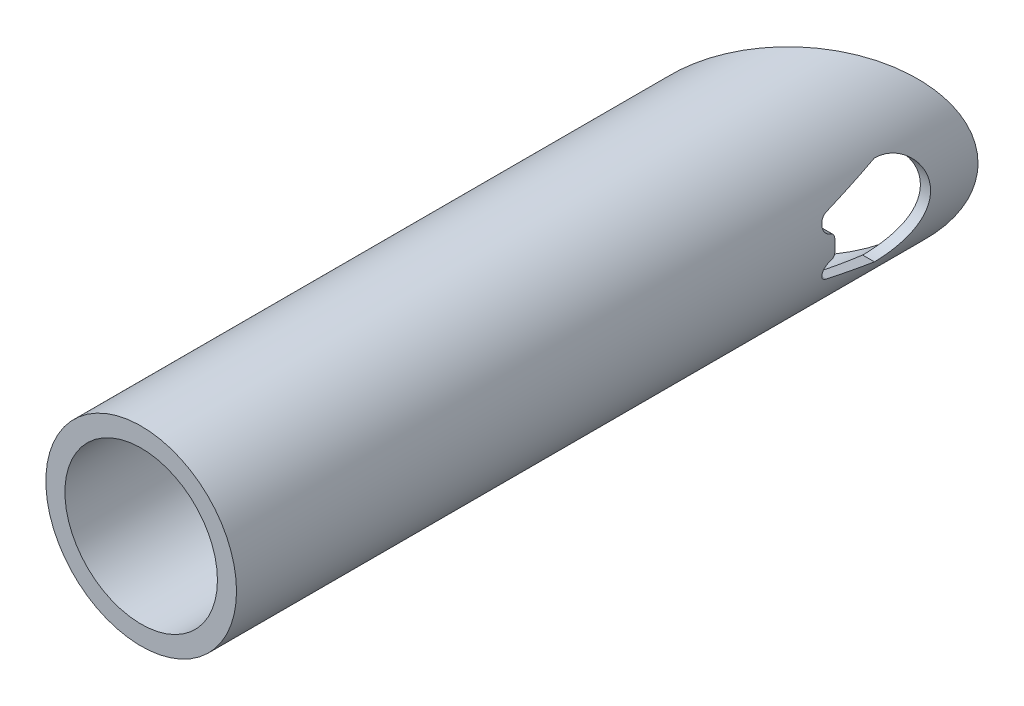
ISO-10303-21;
HEADER;
FILE_DESCRIPTION(('STEP AP214'),'2;1');
FILE_NAME('part.step','',(''),(''),'','','');
FILE_SCHEMA(('AUTOMOTIVE_DESIGN { 1 0 10303 214 1 1 1 1 }'));
ENDSEC;
DATA;
#1=APPLICATION_CONTEXT('core data for automotive mechanical design processes');
#2=APPLICATION_PROTOCOL_DEFINITION('international standard','automotive_design',2000,#1);
#3=PRODUCT_CONTEXT('',#1,'mechanical');
#4=PRODUCT('Part','Part','',(#3));
#5=PRODUCT_RELATED_PRODUCT_CATEGORY('part','',(#4));
#6=PRODUCT_DEFINITION_FORMATION('','',#4);
#7=PRODUCT_DEFINITION_CONTEXT('part definition',#1,'design');
#8=PRODUCT_DEFINITION('design','',#6,#7);
#9=PRODUCT_DEFINITION_SHAPE('','',#8);
#10=(LENGTH_UNIT() NAMED_UNIT(*) SI_UNIT(.MILLI.,.METRE.));
#11=(NAMED_UNIT(*) PLANE_ANGLE_UNIT() SI_UNIT($,.RADIAN.));
#12=(NAMED_UNIT(*) SI_UNIT($,.STERADIAN.) SOLID_ANGLE_UNIT());
#13=UNCERTAINTY_MEASURE_WITH_UNIT(LENGTH_MEASURE(1.E-05),#10,'distance_accuracy_value','');
#14=(GEOMETRIC_REPRESENTATION_CONTEXT(3) GLOBAL_UNCERTAINTY_ASSIGNED_CONTEXT((#13)) GLOBAL_UNIT_ASSIGNED_CONTEXT((#10,
#11,#12)) REPRESENTATION_CONTEXT('',''));
#15=CARTESIAN_POINT('',(0.,0.,0.));
#16=DIRECTION('',(0.,0.,1.));
#17=DIRECTION('',(1.,0.,0.));
#18=AXIS2_PLACEMENT_3D('',#15,#16,#17);
#19=CARTESIAN_POINT('',(0.,0.,111.125));
#20=DIRECTION('',(0.,0.,-1.));
#21=DIRECTION('',(-1.,0.,0.));
#22=AXIS2_PLACEMENT_3D('',#19,#20,#21);
#23=CYLINDRICAL_SURFACE('',#22,12.7635);
#24=CARTESIAN_POINT('',(0.,0.,34.925));
#25=DIRECTION('',(0.,0.,1.));
#26=DIRECTION('',(1.,0.,0.));
#27=AXIS2_PLACEMENT_3D('',#24,#25,#26);
#28=CIRCLE('',#27,12.7635);
#29=CARTESIAN_POINT('',(12.7635,0.,34.925));
#30=VERTEX_POINT('',#29);
#31=EDGE_CURVE('E284',#30,#30,#28,.T.);
#32=ORIENTED_EDGE('',*,*,#31,.T.);
#33=EDGE_LOOP('',(#32));
#34=FACE_BOUND('',#33,.T.);
#35=CARTESIAN_POINT('',(0.,0.,12.7));
#36=DIRECTION('',(0.66436383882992,0.,0.74740931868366));
#37=DIRECTION('',(0.74740931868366,0.,-0.66436383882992));
#38=AXIS2_PLACEMENT_3D('',#35,#36,#37);
#39=ELLIPSE('',#38,17.0769880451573,12.7635);
#40=CARTESIAN_POINT('',(12.7635,0.,1.35466666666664));
#41=VERTEX_POINT('',#40);
#42=EDGE_CURVE('E289',#41,#41,#39,.T.);
#43=ORIENTED_EDGE('',*,*,#42,.F.);
#44=EDGE_LOOP('',(#43));
#45=FACE_BOUND('',#44,.T.);
#46=CARTESIAN_POINT('',(0.,0.,21.4336824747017));
#47=DIRECTION('',(0.,0.,-1.));
#48=DIRECTION('',(-1.,0.,0.));
#49=AXIS2_PLACEMENT_3D('',#46,#47,#48);
#50=CIRCLE('',#49,12.7635);
#51=CARTESIAN_POINT('',(12.7236810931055,1.00740840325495,21.4336824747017));
#52=VERTEX_POINT('',#51);
#53=CARTESIAN_POINT('',(12.7236810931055,-1.00740840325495,21.4336824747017));
#54=VERTEX_POINT('',#53);
#55=EDGE_CURVE('E246',#52,#54,#50,.T.);
#56=ORIENTED_EDGE('',*,*,#55,.T.);
#57=CARTESIAN_POINT('',(12.7236810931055,-1.00740840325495,21.4336824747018));
#58=CARTESIAN_POINT('',(12.7202801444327,-1.05046942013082,21.43364695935));
#59=CARTESIAN_POINT('',(12.7166451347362,-1.09349821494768,21.4373302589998));
#60=CARTESIAN_POINT('',(12.7090669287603,-1.17826215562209,21.4518509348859));
#61=CARTESIAN_POINT('',(12.7051240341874,-1.2199985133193,21.4626813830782));
#62=CARTESIAN_POINT('',(12.6970816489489,-1.30104798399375,21.491217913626));
#63=CARTESIAN_POINT('',(12.6929821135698,-1.3403603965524,21.5089259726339));
#64=CARTESIAN_POINT('',(12.6848271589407,-1.4154562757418,21.550712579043));
#65=CARTESIAN_POINT('',(12.680771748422,-1.45123905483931,21.5747923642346));
#66=CARTESIAN_POINT('',(12.6729153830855,-1.51831947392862,21.6286987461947));
#67=CARTESIAN_POINT('',(12.6691149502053,-1.54960805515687,21.6585366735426));
#68=CARTESIAN_POINT('',(12.6620016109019,-1.60669718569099,21.7230856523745));
#69=CARTESIAN_POINT('',(12.6586880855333,-1.63250472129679,21.7577904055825));
#70=CARTESIAN_POINT('',(12.6546127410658,-1.66366513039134,21.8080851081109));
#71=CARTESIAN_POINT('',(12.65355221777,-1.67170798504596,21.8220383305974));
#72=CARTESIAN_POINT('',(12.6515380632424,-1.68688321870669,21.850406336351));
#73=CARTESIAN_POINT('',(12.650584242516,-1.69401721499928,21.8648202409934));
#74=CARTESIAN_POINT('',(12.6496867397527,-1.70069328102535,21.8794545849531));
#75=B_SPLINE_CURVE_WITH_KNOTS('',3,(#57,#58,#59,#60,#61,#62,#63,#64,#65,#66,#67,#68,#69,#70,#71,
#72,#73,#74),.UNSPECIFIED.,.F.,.F.,(4,2,2,2,2,2,2,2,4),(0.,0.12940849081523,0.258691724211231,
0.388012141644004,0.517357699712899,0.646960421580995,0.776396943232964,0.824792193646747,
0.873100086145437),.UNSPECIFIED.);
#76=CARTESIAN_POINT('',(12.6496867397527,-1.70069328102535,21.8794545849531));
#77=VERTEX_POINT('',#76);
#78=EDGE_CURVE('E232',#54,#77,#75,.T.);
#79=ORIENTED_EDGE('',*,*,#78,.T.);
#80=CARTESIAN_POINT('',(0.,0.,18.1509253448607));
#81=DIRECTION('',(0.,-0.909822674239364,-0.414997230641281));
#82=DIRECTION('',(0.,0.414997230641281,-0.909822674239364));
#83=AXIS2_PLACEMENT_3D('',#80,#81,#82);
#84=ELLIPSE('',#83,30.7556269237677,12.7635);
#85=CARTESIAN_POINT('',(12.6240083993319,-1.88184595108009,22.2766061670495));
#86=VERTEX_POINT('',#85);
#87=EDGE_CURVE('E167',#77,#86,#84,.T.);
#88=ORIENTED_EDGE('',*,*,#87,.T.);
#89=CARTESIAN_POINT('',(12.6240083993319,-1.88184595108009,22.2766061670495));
#90=CARTESIAN_POINT('',(12.6217259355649,-1.89715337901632,22.3101656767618));
#91=CARTESIAN_POINT('',(12.619207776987,-1.91385907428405,22.3430515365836));
#92=CARTESIAN_POINT('',(12.6136822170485,-1.94994624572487,22.4072739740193));
#93=CARTESIAN_POINT('',(12.6106748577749,-1.96932749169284,22.4386106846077));
#94=CARTESIAN_POINT('',(12.6009053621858,-2.03122031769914,22.5298737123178));
#95=CARTESIAN_POINT('',(12.5933862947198,-2.07754681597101,22.5871966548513));
#96=CARTESIAN_POINT('',(12.576246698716,-2.17889582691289,22.6931582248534));
#97=CARTESIAN_POINT('',(12.5666255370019,-2.23392095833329,22.7417942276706));
#98=CARTESIAN_POINT('',(12.5452482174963,-2.35100276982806,22.8291095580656));
#99=CARTESIAN_POINT('',(12.5334922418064,-2.41305884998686,22.8677897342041));
#100=CARTESIAN_POINT('',(12.5078004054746,-2.54288624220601,22.9345110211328));
#101=CARTESIAN_POINT('',(12.4938475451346,-2.61070004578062,22.9624627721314));
#102=CARTESIAN_POINT('',(12.4640069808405,-2.74963823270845,23.0066809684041));
#103=CARTESIAN_POINT('',(12.4481188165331,-2.82076340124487,23.0229446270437));
#104=CARTESIAN_POINT('',(12.4143455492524,-2.9659106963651,23.0437498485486));
#105=CARTESIAN_POINT('',(12.3964244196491,-3.0399621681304,23.0480277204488));
#106=CARTESIAN_POINT('',(12.3593308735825,-3.18742162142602,23.0441749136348));
#107=CARTESIAN_POINT('',(12.3401583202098,-3.2608295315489,23.0360428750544));
#108=CARTESIAN_POINT('',(12.300590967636,-3.40709426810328,23.007313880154));
#109=CARTESIAN_POINT('',(12.2801770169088,-3.47987932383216,22.9863774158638));
#110=CARTESIAN_POINT('',(12.2393665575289,-3.62080458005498,22.9323638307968));
#111=CARTESIAN_POINT('',(12.218970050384,-3.68894441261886,22.8992857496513));
#112=CARTESIAN_POINT('',(12.1787359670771,-3.81969535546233,22.8212440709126));
#113=CARTESIAN_POINT('',(12.1589109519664,-3.8822108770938,22.7761134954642));
#114=CARTESIAN_POINT('',(12.1210822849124,-3.99875717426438,22.6752687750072));
#115=CARTESIAN_POINT('',(12.1030795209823,-4.0527838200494,22.6195495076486));
#116=CARTESIAN_POINT('',(12.0702208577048,-4.14961086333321,22.5001225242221));
#117=CARTESIAN_POINT('',(12.0553117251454,-4.19260483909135,22.4365864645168));
#118=CARTESIAN_POINT('',(12.0291668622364,-4.26704173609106,22.3025388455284));
#119=CARTESIAN_POINT('',(12.0179207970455,-4.29851718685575,22.2320476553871));
#120=CARTESIAN_POINT('',(12.006325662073,-4.3307188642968,22.1386374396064));
#121=CARTESIAN_POINT('',(12.0039485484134,-4.33730113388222,22.1178849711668));
#122=CARTESIAN_POINT('',(12.0017559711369,-4.34336112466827,22.0969720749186));
#123=B_SPLINE_CURVE_WITH_KNOTS('',3,(#89,#90,#91,#92,#93,#94,#95,#96,#97,#98,#99,#100,#101,#102,
#103,#104,#105,#106,#107,#108,#109,#110,#111,#112,#113,#114,#115,#116,#117,#118,#119,#120,#121,
#122),.UNSPECIFIED.,.F.,.F.,(4,2,2,2,2,2,2,2,2,2,2,2,2,2,2,2,4),(0.,0.110799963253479,
0.221590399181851,0.442702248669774,0.663880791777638,0.885040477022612,1.10800422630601,
1.33102111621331,1.55890731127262,1.78681847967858,2.02105169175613,2.25530343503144,
2.49298598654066,2.73078381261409,2.96406910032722,3.19669038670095,3.26236128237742),.UNSPECIFIED.);
#124=CARTESIAN_POINT('',(12.0017559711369,-4.34336112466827,22.0969720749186));
#125=VERTEX_POINT('',#124);
#126=EDGE_CURVE('E159',#86,#125,#123,.T.);
#127=ORIENTED_EDGE('',*,*,#126,.T.);
#128=CARTESIAN_POINT('',(0.,0.,37.0748335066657));
#129=DIRECTION('',(0.,0.960432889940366,-0.278511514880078));
#130=DIRECTION('',(0.,-0.278511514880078,-0.960432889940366));
#131=AXIS2_PLACEMENT_3D('',#128,#129,#130);
#132=ELLIPSE('',#131,45.8275486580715,12.7635);
#133=CARTESIAN_POINT('',(10.8408720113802,-6.73664800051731,13.8438431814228));
#134=VERTEX_POINT('',#133);
#135=EDGE_CURVE('E157',#125,#134,#132,.T.);
#136=ORIENTED_EDGE('',*,*,#135,.T.);
#137=CARTESIAN_POINT('',(10.8408720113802,-6.73664800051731,13.8438431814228));
#138=CARTESIAN_POINT('',(10.8408142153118,-6.7366827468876,13.6689739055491));
#139=CARTESIAN_POINT('',(10.8451012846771,-6.72984083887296,13.4941326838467));
#140=CARTESIAN_POINT('',(10.8619332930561,-6.70267115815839,13.1460200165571));
#141=CARTESIAN_POINT('',(10.8744724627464,-6.68235280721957,12.9727475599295));
#142=CARTESIAN_POINT('',(10.9072740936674,-6.62866694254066,12.6301224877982));
#143=CARTESIAN_POINT('',(10.9274873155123,-6.59538258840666,12.4607520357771));
#144=CARTESIAN_POINT('',(10.974886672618,-6.51620552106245,12.1259728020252));
#145=CARTESIAN_POINT('',(11.0020737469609,-6.47031110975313,11.9605645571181));
#146=CARTESIAN_POINT('',(11.0624220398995,-6.366579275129,11.6351845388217));
#147=CARTESIAN_POINT('',(11.095566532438,-6.30877522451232,11.4751989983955));
#148=CARTESIAN_POINT('',(11.166863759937,-6.18169820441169,11.1609748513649));
#149=CARTESIAN_POINT('',(11.2050184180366,-6.1124208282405,11.0067384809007));
#150=CARTESIAN_POINT('',(11.3254966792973,-5.88803135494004,10.553362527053));
#151=CARTESIAN_POINT('',(11.4137855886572,-5.71644227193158,10.2638052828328));
#152=CARTESIAN_POINT('',(11.6060996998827,-5.31591739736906,9.68969107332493));
#153=CARTESIAN_POINT('',(11.7108254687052,-5.08316359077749,9.4080324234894));
#154=CARTESIAN_POINT('',(11.8665435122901,-4.70223380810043,9.01635327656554));
#155=CARTESIAN_POINT('',(11.9182464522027,-4.56988365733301,8.89087366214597));
#156=CARTESIAN_POINT('',(12.020028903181,-4.295030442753,8.65072955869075));
#157=CARTESIAN_POINT('',(12.0701081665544,-4.15252584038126,8.53606671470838));
#158=CARTESIAN_POINT('',(12.1712269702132,-3.84657070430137,8.3098318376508));
#159=CARTESIAN_POINT('',(12.2220383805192,-3.68235308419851,8.19919344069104));
#160=CARTESIAN_POINT('',(12.3189502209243,-3.34385552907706,7.99231539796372));
#161=CARTESIAN_POINT('',(12.3650526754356,-3.16957996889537,7.89606955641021));
#162=CARTESIAN_POINT('',(12.4512355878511,-2.81202231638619,7.71891457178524));
#163=CARTESIAN_POINT('',(12.4913177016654,-2.62874271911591,7.63800120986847));
#164=CARTESIAN_POINT('',(12.5642643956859,-2.2544462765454,7.49244937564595));
#165=CARTESIAN_POINT('',(12.5971298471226,-2.06343036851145,7.42780893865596));
#166=CARTESIAN_POINT('',(12.6523705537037,-1.69032644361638,7.32004507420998));
#167=CARTESIAN_POINT('',(12.6753629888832,-1.50869991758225,7.27563894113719));
#168=CARTESIAN_POINT('',(12.7136829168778,-1.14159761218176,7.20198958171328));
#169=CARTESIAN_POINT('',(12.7290107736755,-0.956122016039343,7.1727456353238));
#170=CARTESIAN_POINT('',(12.7515476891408,-0.58299118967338,7.12984320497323));
#171=CARTESIAN_POINT('',(12.7587613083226,-0.395337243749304,7.11617596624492));
#172=CARTESIAN_POINT('',(12.7648691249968,-0.0194138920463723,7.10459959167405));
#173=CARTESIAN_POINT('',(12.7637639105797,0.168855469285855,7.10668934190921));
#174=CARTESIAN_POINT('',(12.7537808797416,0.526101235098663,7.12562373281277));
#175=CARTESIAN_POINT('',(12.7456670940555,0.695178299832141,7.14101807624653));
#176=CARTESIAN_POINT('',(12.7228813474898,1.03131215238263,7.18444781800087));
#177=CARTESIAN_POINT('',(12.7082071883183,1.19836824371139,7.2124874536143));
#178=CARTESIAN_POINT('',(12.6726541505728,1.52919600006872,7.28087822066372));
#179=CARTESIAN_POINT('',(12.6517775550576,1.69296884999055,7.32122482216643));
#180=CARTESIAN_POINT('',(12.6042889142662,2.01632158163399,7.41382205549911));
#181=CARTESIAN_POINT('',(12.5776746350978,2.17589980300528,7.46607732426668));
#182=CARTESIAN_POINT('',(12.5189516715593,2.49176347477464,7.5826759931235));
#183=CARTESIAN_POINT('',(12.4867812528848,2.64798696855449,7.64715610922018));
#184=CARTESIAN_POINT('',(12.4178679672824,2.95434970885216,7.78722339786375));
#185=CARTESIAN_POINT('',(12.3811235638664,3.10448688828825,7.86281430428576));
#186=CARTESIAN_POINT('',(12.2651701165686,3.54462878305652,8.1053621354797));
#187=CARTESIAN_POINT('',(12.1802045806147,3.82455136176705,8.28816406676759));
#188=CARTESIAN_POINT('',(11.992506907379,4.3796286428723,8.71203912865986));
#189=CARTESIAN_POINT('',(11.8888465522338,4.65138385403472,8.95715433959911));
#190=CARTESIAN_POINT('',(11.7328326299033,5.02653368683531,9.35499906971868));
#191=CARTESIAN_POINT('',(11.6806947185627,5.14626067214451,9.49277698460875));
#192=CARTESIAN_POINT('',(11.5775079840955,5.3743731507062,9.77790462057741));
#193=CARTESIAN_POINT('',(11.5264593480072,5.48275670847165,9.92525596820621));
#194=CARTESIAN_POINT('',(11.4229409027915,5.69547378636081,10.2406572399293));
#195=CARTESIAN_POINT('',(11.3706685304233,5.79883934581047,10.4094259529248));
#196=CARTESIAN_POINT('',(11.2707275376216,5.99077104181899,10.756390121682));
#197=CARTESIAN_POINT('',(11.2230568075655,6.07934397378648,10.9345811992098));
#198=CARTESIAN_POINT('',(11.134145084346,6.24069062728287,11.299074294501));
#199=CARTESIAN_POINT('',(11.0928910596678,6.31349649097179,11.4853588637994));
#200=CARTESIAN_POINT('',(11.0184115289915,6.44260114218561,11.8650843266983));
#201=CARTESIAN_POINT('',(10.9851826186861,6.49890693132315,12.0585221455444));
#202=CARTESIAN_POINT('',(10.9380252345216,6.57783045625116,12.3836412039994));
#203=CARTESIAN_POINT('',(10.9213856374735,6.60537947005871,12.5137557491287));
#204=CARTESIAN_POINT('',(10.8925741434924,6.6527835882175,12.7758444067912));
#205=CARTESIAN_POINT('',(10.880400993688,6.67264085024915,12.9078179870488));
#206=CARTESIAN_POINT('',(10.860773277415,6.70454384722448,13.1734329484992));
#207=CARTESIAN_POINT('',(10.8533320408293,6.71656751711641,13.3070779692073));
#208=CARTESIAN_POINT('',(10.8433699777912,6.73262764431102,13.5750932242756));
#209=CARTESIAN_POINT('',(10.8408515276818,6.73666024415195,13.7094637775));
#210=CARTESIAN_POINT('',(10.8408720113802,6.73664800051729,13.8438431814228));
#211=B_SPLINE_CURVE_WITH_KNOTS('',3,(#137,#138,#139,#140,#141,#142,#143,#144,#145,#146,#147,
#148,#149,#150,#151,#152,#153,#154,#155,#156,#157,#158,#159,#160,#161,#162,#163,#164,#165,#166,
#167,#168,#169,#170,#171,#172,#173,#174,#175,#176,#177,#178,#179,#180,#181,#182,#183,#184,#185,
#186,#187,#188,#189,#190,#191,#192,#193,#194,#195,#196,#197,#198,#199,#200,#201,#202,#203,#204,
#205,#206,#207,#208,#209,#210),.UNSPECIFIED.,.F.,.F.,(4,2,2,2,2,2,2,2,2,2,2,2,2,2,2,2,2,2,2,2,2,
2,2,2,2,2,2,2,2,2,2,2,2,2,2,2,4),(0.,0.524377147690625,1.04838807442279,1.5690920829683,
2.08986624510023,2.60920049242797,3.12873467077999,4.16859335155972,5.30389535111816,
5.87211155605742,6.4404140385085,7.05290696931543,7.66513546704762,8.27719526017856,
8.88918112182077,9.45355766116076,10.0179073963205,10.5819397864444,11.1459323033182,
11.6552394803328,12.1647174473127,12.6740081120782,13.1834974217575,13.6990622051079,
14.2148006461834,15.2456739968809,16.3817106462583,16.9507297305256,17.5198457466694,
18.1331529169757,18.746177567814,19.3579405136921,19.969443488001,20.3712747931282,
20.7729932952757,21.1758384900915,21.5788780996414),.UNSPECIFIED.);
#212=CARTESIAN_POINT('',(10.8408720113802,6.73664800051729,13.8438431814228));
#213=VERTEX_POINT('',#212);
#214=EDGE_CURVE('E141',#134,#213,#211,.T.);
#215=ORIENTED_EDGE('',*,*,#214,.T.);
#216=CARTESIAN_POINT('',(0.,0.,37.0748335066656));
#217=DIRECTION('',(0.,-0.960432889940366,-0.278511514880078));
#218=DIRECTION('',(0.,0.278511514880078,-0.960432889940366));
#219=AXIS2_PLACEMENT_3D('',#216,#217,#218);
#220=ELLIPSE('',#219,45.8275486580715,12.7635);
#221=CARTESIAN_POINT('',(12.0017559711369,4.34336112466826,22.0969720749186));
#222=VERTEX_POINT('',#221);
#223=EDGE_CURVE('E258',#213,#222,#220,.T.);
#224=ORIENTED_EDGE('',*,*,#223,.T.);
#225=CARTESIAN_POINT('',(12.0017559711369,4.34336112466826,22.0969720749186));
#226=CARTESIAN_POINT('',(12.0054667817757,4.33310502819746,22.1323418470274));
#227=CARTESIAN_POINT('',(12.0096949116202,4.32138292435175,22.1672100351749));
#228=CARTESIAN_POINT('',(12.019111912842,4.29512284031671,22.2357218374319));
#229=CARTESIAN_POINT('',(12.0243004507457,4.28058583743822,22.2693658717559));
#230=CARTESIAN_POINT('',(12.0411599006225,4.23302839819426,22.3679297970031));
#231=CARTESIAN_POINT('',(12.0541523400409,4.19598625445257,22.4307382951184));
#232=CARTESIAN_POINT('',(12.0828838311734,4.1125162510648,22.5488977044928));
#233=CARTESIAN_POINT('',(12.0986203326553,4.06609709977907,22.6042554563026));
#234=CARTESIAN_POINT('',(12.132064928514,3.96519300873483,22.7064076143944));
#235=CARTESIAN_POINT('',(12.1497741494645,3.91070345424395,22.753197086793));
#236=CARTESIAN_POINT('',(12.1871047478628,3.79280612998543,22.8388560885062));
#237=CARTESIAN_POINT('',(12.2067743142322,3.72912846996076,22.8773330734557));
#238=CARTESIAN_POINT('',(12.246558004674,3.59632492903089,22.9430101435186));
#239=CARTESIAN_POINT('',(12.2666722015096,3.52719815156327,22.9702083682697));
#240=CARTESIAN_POINT('',(12.3072339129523,3.38300245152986,23.013309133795));
#241=CARTESIAN_POINT('',(12.3276715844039,3.30781430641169,23.0288235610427));
#242=CARTESIAN_POINT('',(12.367507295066,3.15561118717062,23.0465682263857));
#243=CARTESIAN_POINT('',(12.3869053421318,3.07859622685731,23.0487985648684));
#244=CARTESIAN_POINT('',(12.4239889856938,2.92534013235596,23.0397555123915));
#245=CARTESIAN_POINT('',(12.4416825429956,2.84909705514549,23.0285485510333));
#246=CARTESIAN_POINT('',(12.4750334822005,2.69932538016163,22.992855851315));
#247=CARTESIAN_POINT('',(12.4906913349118,2.62579615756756,22.968373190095));
#248=CARTESIAN_POINT('',(12.5193159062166,2.48568798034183,22.9074960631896));
#249=CARTESIAN_POINT('',(12.5323431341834,2.41897616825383,22.8714358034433));
#250=CARTESIAN_POINT('',(12.5561088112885,2.29242574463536,22.7881402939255));
#251=CARTESIAN_POINT('',(12.5668464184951,2.23258966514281,22.7409009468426));
#252=CARTESIAN_POINT('',(12.5857980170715,2.12312018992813,22.6378607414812));
#253=CARTESIAN_POINT('',(12.5940665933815,2.07327565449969,22.5822936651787));
#254=CARTESIAN_POINT('',(12.6084904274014,1.98367500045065,22.4634486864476));
#255=CARTESIAN_POINT('',(12.6146505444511,1.94389574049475,22.4001889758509));
#256=CARTESIAN_POINT('',(12.62129518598,1.89998253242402,22.3151288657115));
#257=CARTESIAN_POINT('',(12.6226918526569,1.89067597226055,22.2959733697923));
#258=CARTESIAN_POINT('',(12.6240083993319,1.88184595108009,22.2766061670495));
#259=B_SPLINE_CURVE_WITH_KNOTS('',3,(#225,#226,#227,#228,#229,#230,#231,#232,#233,#234,#235,
#236,#237,#238,#239,#240,#241,#242,#243,#244,#245,#246,#247,#248,#249,#250,#251,#252,#253,#254,
#255,#256,#257,#258),.UNSPECIFIED.,.F.,.F.,(4,2,2,2,2,2,2,2,2,2,2,2,2,2,2,2,4),(0.,
0.110963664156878,0.221888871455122,0.442942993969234,0.663792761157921,0.884769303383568,
1.11460164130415,1.34447187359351,1.58167680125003,1.81887993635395,2.05491523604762,
2.29089584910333,2.52059886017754,2.75038619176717,2.97463538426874,3.19836421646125,
3.26236300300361),.UNSPECIFIED.);
#260=CARTESIAN_POINT('',(12.6240083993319,1.88184595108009,22.2766061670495));
#261=VERTEX_POINT('',#260);
#262=EDGE_CURVE('E250',#222,#261,#259,.T.);
#263=ORIENTED_EDGE('',*,*,#262,.T.);
#264=CARTESIAN_POINT('',(0.,0.,18.1509253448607));
#265=DIRECTION('',(0.,0.909822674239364,-0.414997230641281));
#266=DIRECTION('',(0.,-0.414997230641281,-0.909822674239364));
#267=AXIS2_PLACEMENT_3D('',#264,#265,#266);
#268=ELLIPSE('',#267,30.7556269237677,12.7635);
#269=CARTESIAN_POINT('',(12.6496867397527,1.70069328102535,21.8794545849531));
#270=VERTEX_POINT('',#269);
#271=EDGE_CURVE('E248',#261,#270,#268,.T.);
#272=ORIENTED_EDGE('',*,*,#271,.T.);
#273=CARTESIAN_POINT('',(12.6496867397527,1.70069328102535,21.8794545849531));
#274=CARTESIAN_POINT('',(12.6520777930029,1.68289742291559,21.8403539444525));
#275=CARTESIAN_POINT('',(12.6548844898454,1.66175025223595,21.8028259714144));
#276=CARTESIAN_POINT('',(12.6611237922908,1.61352891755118,21.731911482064));
#277=CARTESIAN_POINT('',(12.6645556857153,1.58646149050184,21.6985203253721));
#278=CARTESIAN_POINT('',(12.6718469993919,1.52712614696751,21.6367770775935));
#279=CARTESIAN_POINT('',(12.6757064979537,1.49485727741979,21.6084259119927));
#280=CARTESIAN_POINT('',(12.6836336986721,1.42603193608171,21.5575375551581));
#281=CARTESIAN_POINT('',(12.6877014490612,1.3894744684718,21.5350017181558));
#282=CARTESIAN_POINT('',(12.6958535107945,1.31290719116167,21.4962784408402));
#283=CARTESIAN_POINT('',(12.6999377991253,1.27288052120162,21.480124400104));
#284=CARTESIAN_POINT('',(12.7079073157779,1.19068105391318,21.4548051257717));
#285=CARTESIAN_POINT('',(12.7117927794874,1.14851091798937,21.4456314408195));
#286=CARTESIAN_POINT('',(12.716919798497,1.08956652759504,21.4379444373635));
#287=CARTESIAN_POINT('',(12.7183145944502,1.07316306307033,21.4363456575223));
#288=CARTESIAN_POINT('',(12.7210436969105,1.04031244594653,21.4342160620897));
#289=CARTESIAN_POINT('',(12.7223781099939,1.02386542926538,21.4336832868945));
#290=CARTESIAN_POINT('',(12.7236810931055,1.00740840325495,21.4336824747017));
#291=B_SPLINE_CURVE_WITH_KNOTS('',3,(#273,#274,#275,#276,#277,#278,#279,#280,#281,#282,#283,
#284,#285,#286,#287,#288,#289,#290),.UNSPECIFIED.,.F.,.F.,(4,2,2,2,2,2,2,2,4),(0.,
0.128897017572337,0.257648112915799,0.386422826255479,0.515227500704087,0.644697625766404,
0.774010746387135,0.823604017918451,0.873106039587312),.UNSPECIFIED.);
#292=EDGE_CURVE('E233',#270,#52,#291,.T.);
#293=ORIENTED_EDGE('',*,*,#292,.T.);
#294=EDGE_LOOP('',(#56,#79,#88,#127,#136,#215,#224,#263,#272,#293));
#295=FACE_BOUND('',#294,.T.);
#296=ADVANCED_FACE('F35',(#34,#45,#295),#23,.F.);
#297=CARTESIAN_POINT('',(0.,0.,111.125));
#298=DIRECTION('',(0.,0.,-1.));
#299=DIRECTION('',(-1.,0.,0.));
#300=AXIS2_PLACEMENT_3D('',#297,#298,#299);
#301=CYLINDRICAL_SURFACE('',#300,14.2875);
#302=CARTESIAN_POINT('',(0.,0.,111.125));
#303=DIRECTION('',(0.,0.,1.));
#304=DIRECTION('',(1.,0.,0.));
#305=AXIS2_PLACEMENT_3D('',#302,#303,#304);
#306=CIRCLE('',#305,14.2875);
#307=CARTESIAN_POINT('',(14.2875,0.,111.125));
#308=VERTEX_POINT('',#307);
#309=EDGE_CURVE('E288',#308,#308,#306,.T.);
#310=ORIENTED_EDGE('',*,*,#309,.F.);
#311=EDGE_LOOP('',(#310));
#312=FACE_BOUND('',#311,.T.);
#313=CARTESIAN_POINT('',(0.,0.,12.7));
#314=DIRECTION('',(0.66436383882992,0.,0.74740931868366));
#315=DIRECTION('',(0.74740931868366,0.,-0.66436383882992));
#316=AXIS2_PLACEMENT_3D('',#313,#314,#315);
#317=ELLIPSE('',#316,19.1160313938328,14.2875);
#318=CARTESIAN_POINT('',(14.2875,0.,0.));
#319=VERTEX_POINT('',#318);
#320=EDGE_CURVE('E285',#319,#319,#317,.T.);
#321=ORIENTED_EDGE('',*,*,#320,.T.);
#322=EDGE_LOOP('',(#321));
#323=FACE_BOUND('',#322,.T.);
#324=CARTESIAN_POINT('',(0.,0.,18.1509253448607));
#325=DIRECTION('',(0.,-0.909822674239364,-0.414997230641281));
#326=DIRECTION('',(0.,0.414997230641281,-0.909822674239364));
#327=AXIS2_PLACEMENT_3D('',#324,#325,#326);
#328=ELLIPSE('',#327,34.4279405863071,14.2875);
#329=CARTESIAN_POINT('',(14.185919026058,-1.70069328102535,21.8794545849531));
#330=VERTEX_POINT('',#329);
#331=CARTESIAN_POINT('',(14.1630262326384,-1.88184595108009,22.2766061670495));
#332=VERTEX_POINT('',#331);
#333=EDGE_CURVE('E126',#330,#332,#328,.T.);
#334=ORIENTED_EDGE('',*,*,#333,.F.);
#335=CARTESIAN_POINT('',(14.185919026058,-1.70069328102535,21.8794545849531));
#336=CARTESIAN_POINT('',(14.1880501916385,-1.68290515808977,21.8403704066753));
#337=CARTESIAN_POINT('',(14.1905522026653,-1.66176563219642,21.8028523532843));
#338=CARTESIAN_POINT('',(14.1961153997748,-1.61355533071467,21.7319465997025));
#339=CARTESIAN_POINT('',(14.1991759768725,-1.5864910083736,21.6985544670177));
#340=CARTESIAN_POINT('',(14.2056799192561,-1.52715420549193,21.6368028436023));
#341=CARTESIAN_POINT('',(14.2091233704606,-1.49488055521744,21.6084444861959));
#342=CARTESIAN_POINT('',(14.2161970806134,-1.4260409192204,21.557542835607));
#343=CARTESIAN_POINT('',(14.2198273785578,-1.38947403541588,21.5350007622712));
#344=CARTESIAN_POINT('',(14.2271000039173,-1.31292258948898,21.4962869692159));
#345=CARTESIAN_POINT('',(14.2307423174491,-1.27292425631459,21.4801425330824));
#346=CARTESIAN_POINT('',(14.2378500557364,-1.19078703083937,21.4548331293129));
#347=CARTESIAN_POINT('',(14.2413156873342,-1.14865076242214,21.4456598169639));
#348=CARTESIAN_POINT('',(14.2458925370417,-1.08971316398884,21.4379596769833));
#349=CARTESIAN_POINT('',(14.2471400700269,-1.07327978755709,21.4363551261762));
#350=CARTESIAN_POINT('',(14.2495809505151,-1.04037015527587,21.4342179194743));
#351=CARTESIAN_POINT('',(14.2507743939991,-1.02389403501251,21.4336832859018));
#352=CARTESIAN_POINT('',(14.2519396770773,-1.00740840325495,21.4336824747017));
#353=B_SPLINE_CURVE_WITH_KNOTS('',3,(#335,#336,#337,#338,#339,#340,#341,#342,#343,#344,#345,
#346,#347,#348,#349,#350,#351,#352),.UNSPECIFIED.,.F.,.F.,(4,2,2,2,2,2,2,2,4),(0.,
0.128803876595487,0.257468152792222,0.386161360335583,0.514881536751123,0.644144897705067,
0.773253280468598,0.822901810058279,0.872458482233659),.UNSPECIFIED.);
#354=CARTESIAN_POINT('',(14.2519396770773,-1.00740840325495,21.4336824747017));
#355=VERTEX_POINT('',#354);
#356=EDGE_CURVE('E44',#330,#355,#353,.T.);
#357=ORIENTED_EDGE('',*,*,#356,.T.);
#358=CARTESIAN_POINT('',(0.,0.,21.4336824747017));
#359=DIRECTION('',(0.,0.,-1.));
#360=DIRECTION('',(-1.,0.,0.));
#361=AXIS2_PLACEMENT_3D('',#358,#359,#360);
#362=CIRCLE('',#361,14.2875);
#363=CARTESIAN_POINT('',(14.2519396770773,1.00740840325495,21.4336824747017));
#364=VERTEX_POINT('',#363);
#365=EDGE_CURVE('E127',#364,#355,#362,.T.);
#366=ORIENTED_EDGE('',*,*,#365,.F.);
#367=CARTESIAN_POINT('',(14.2519396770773,1.00740840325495,21.4336824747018));
#368=CARTESIAN_POINT('',(14.2489061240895,1.05043090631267,21.4336467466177));
#369=CARTESIAN_POINT('',(14.2456639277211,1.09342557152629,21.4373237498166));
#370=CARTESIAN_POINT('',(14.2389048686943,1.17813019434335,21.4518224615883));
#371=CARTESIAN_POINT('',(14.2353882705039,1.21984133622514,21.4626373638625));
#372=CARTESIAN_POINT('',(14.228215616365,1.30084880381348,21.4911364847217));
#373=CARTESIAN_POINT('',(14.2245595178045,1.340144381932,21.5088228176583));
#374=CARTESIAN_POINT('',(14.2172871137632,1.41521134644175,21.5505593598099));
#375=CARTESIAN_POINT('',(14.2136708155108,1.45098210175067,21.5746107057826));
#376=CARTESIAN_POINT('',(14.206666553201,1.5180326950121,21.6284435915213));
#377=CARTESIAN_POINT('',(14.2032789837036,1.549304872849,21.6582347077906));
#378=CARTESIAN_POINT('',(14.1969381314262,1.60637141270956,21.7226770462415));
#379=CARTESIAN_POINT('',(14.1939843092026,1.63217259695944,21.7573221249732));
#380=CARTESIAN_POINT('',(14.1903427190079,1.66340124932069,21.807634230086));
#381=CARTESIAN_POINT('',(14.189389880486,1.6715055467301,21.8216741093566));
#382=CARTESIAN_POINT('',(14.1875808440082,1.68679126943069,21.8502205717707));
#383=CARTESIAN_POINT('',(14.1867244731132,1.69397434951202,21.8647262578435));
#384=CARTESIAN_POINT('',(14.185919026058,1.70069328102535,21.8794545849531));
#385=B_SPLINE_CURVE_WITH_KNOTS('',3,(#367,#368,#369,#370,#371,#372,#373,#374,#375,#376,#377,
#378,#379,#380,#381,#382,#383,#384),.UNSPECIFIED.,.F.,.F.,(4,2,2,2,2,2,2,2,4),(0.,
0.129212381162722,0.258301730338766,0.387430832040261,0.516583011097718,0.645952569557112,
0.7751598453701,0.823851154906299,0.87245373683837),.UNSPECIFIED.);
#386=CARTESIAN_POINT('',(14.185919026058,1.70069328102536,21.8794545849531));
#387=VERTEX_POINT('',#386);
#388=EDGE_CURVE('E51',#364,#387,#385,.T.);
#389=ORIENTED_EDGE('',*,*,#388,.T.);
#390=CARTESIAN_POINT('',(0.,0.,18.1509253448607));
#391=DIRECTION('',(0.,0.909822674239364,-0.414997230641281));
#392=DIRECTION('',(0.,-0.414997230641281,-0.909822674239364));
#393=AXIS2_PLACEMENT_3D('',#390,#391,#392);
#394=ELLIPSE('',#393,34.4279405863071,14.2875);
#395=CARTESIAN_POINT('',(14.1630262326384,1.88184595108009,22.2766061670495));
#396=VERTEX_POINT('',#395);
#397=EDGE_CURVE('E136',#396,#387,#394,.T.);
#398=ORIENTED_EDGE('',*,*,#397,.F.);
#399=CARTESIAN_POINT('',(13.6113140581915,4.34336112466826,22.0969720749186));
#400=CARTESIAN_POINT('',(13.6145893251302,4.33309477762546,22.1323766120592));
#401=CARTESIAN_POINT('',(13.6183229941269,4.32135637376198,22.1672905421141));
#402=CARTESIAN_POINT('',(13.6266448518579,4.29504380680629,22.2359167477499));
#403=CARTESIAN_POINT('',(13.6312327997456,4.28047044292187,22.2696293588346));
#404=CARTESIAN_POINT('',(13.6461560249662,4.23275221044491,22.36845345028));
#405=CARTESIAN_POINT('',(13.6576723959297,4.19554224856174,22.4314799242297));
#406=CARTESIAN_POINT('',(13.6831841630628,4.11157443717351,22.5501158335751));
#407=CARTESIAN_POINT('',(13.6971779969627,4.06482260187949,22.6057299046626));
#408=CARTESIAN_POINT('',(13.7269541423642,3.96310374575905,22.7083323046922));
#409=CARTESIAN_POINT('',(13.7427372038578,3.90813327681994,22.7553169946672));
#410=CARTESIAN_POINT('',(13.7758934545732,3.7896323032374,22.84088747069));
#411=CARTESIAN_POINT('',(13.7933010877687,3.72588656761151,22.8791617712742));
#412=CARTESIAN_POINT('',(13.8285219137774,3.59296027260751,22.9444371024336));
#413=CARTESIAN_POINT('',(13.8463351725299,3.52377882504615,22.9714362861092));
#414=CARTESIAN_POINT('',(13.8821437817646,3.37999427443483,23.0139868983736));
#415=CARTESIAN_POINT('',(13.9001323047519,3.30529819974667,23.0292308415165));
#416=CARTESIAN_POINT('',(13.9351998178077,3.15418402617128,23.0466176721));
#417=CARTESIAN_POINT('',(13.9522788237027,3.07776595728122,23.0487607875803));
#418=CARTESIAN_POINT('',(13.9849574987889,2.92568736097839,23.039764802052));
#419=CARTESIAN_POINT('',(14.0005624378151,2.85002507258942,23.0286751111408));
#420=CARTESIAN_POINT('',(14.0299893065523,2.7014426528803,22.99345305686));
#421=CARTESIAN_POINT('',(14.0438115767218,2.62852199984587,22.9693231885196));
#422=CARTESIAN_POINT('',(14.0691718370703,2.4891718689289,22.9092286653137));
#423=CARTESIAN_POINT('',(14.0807517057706,2.42263822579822,22.8735232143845));
#424=CARTESIAN_POINT('',(14.1018898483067,2.29640193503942,22.7910613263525));
#425=CARTESIAN_POINT('',(14.1114473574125,2.23670187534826,22.7443007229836));
#426=CARTESIAN_POINT('',(14.1283773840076,2.1271180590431,22.6420520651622));
#427=CARTESIAN_POINT('',(14.1357879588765,2.07706937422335,22.5867466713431));
#428=CARTESIAN_POINT('',(14.1487262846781,1.98702695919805,22.4684268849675));
#429=CARTESIAN_POINT('',(14.1542582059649,1.94701101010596,22.4054299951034));
#430=CARTESIAN_POINT('',(14.1603660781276,1.90178941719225,22.318838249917));
#431=CARTESIAN_POINT('',(14.1617391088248,1.89153079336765,22.2978492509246));
#432=CARTESIAN_POINT('',(14.1630262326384,1.88184595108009,22.2766061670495));
#433=B_SPLINE_CURVE_WITH_KNOTS('',3,(#399,#400,#401,#402,#403,#404,#405,#406,#407,#408,#409,
#410,#411,#412,#413,#414,#415,#416,#417,#418,#419,#420,#421,#422,#423,#424,#425,#426,#427,#428,
#429,#430,#431,#432),.UNSPECIFIED.,.F.,.F.,(4,2,2,2,2,2,2,2,2,2,2,2,2,2,2,2,4),(0.,
0.110950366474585,0.221869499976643,0.44299929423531,0.663990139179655,0.885073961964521,
1.11312775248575,1.34121888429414,1.57509096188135,1.80895896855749,2.04195645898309,
2.27490938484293,2.50296971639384,2.73111613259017,2.95492866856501,3.1782410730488,
3.24841071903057),.UNSPECIFIED.);
#434=CARTESIAN_POINT('',(13.6113140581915,4.34336112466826,22.0969720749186));
#435=VERTEX_POINT('',#434);
#436=EDGE_CURVE('E137',#435,#396,#433,.T.);
#437=ORIENTED_EDGE('',*,*,#436,.F.);
#438=CARTESIAN_POINT('',(0.,0.,37.0748335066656));
#439=DIRECTION('',(0.,-0.960432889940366,-0.278511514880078));
#440=DIRECTION('',(0.,0.278511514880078,-0.960432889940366));
#441=AXIS2_PLACEMENT_3D('',#438,#439,#440);
#442=ELLIPSE('',#441,51.299494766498,14.2875);
#443=CARTESIAN_POINT('',(12.5996122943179,6.73664800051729,13.8438431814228));
#444=VERTEX_POINT('',#443);
#445=EDGE_CURVE('E121',#444,#435,#442,.T.);
#446=ORIENTED_EDGE('',*,*,#445,.F.);
#447=CARTESIAN_POINT('',(12.5996122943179,-6.73664800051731,13.8438431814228));
#448=CARTESIAN_POINT('',(12.5995640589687,-6.7366797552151,13.6659270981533));
#449=CARTESIAN_POINT('',(12.6033792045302,-6.72960131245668,13.4880329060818));
#450=CARTESIAN_POINT('',(12.618378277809,-6.70146619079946,13.1337590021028));
#451=CARTESIAN_POINT('',(12.6295582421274,-6.68041703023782,12.9573785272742));
#452=CARTESIAN_POINT('',(12.6588536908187,-6.62472662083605,12.6083139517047));
#453=CARTESIAN_POINT('',(12.6769329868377,-6.59015627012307,12.4356154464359));
#454=CARTESIAN_POINT('',(12.7193900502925,-6.5078359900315,12.094175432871));
#455=CARTESIAN_POINT('',(12.7437684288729,-6.46008478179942,11.9254343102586));
#456=CARTESIAN_POINT('',(12.797979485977,-6.35200866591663,11.5933233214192));
#457=CARTESIAN_POINT('',(12.8278008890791,-6.29170971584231,11.4299431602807));
#458=CARTESIAN_POINT('',(12.8920301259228,-6.15902992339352,11.1090746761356));
#459=CARTESIAN_POINT('',(12.9264396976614,-6.08664450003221,10.9515886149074));
#460=CARTESIAN_POINT('',(13.0351839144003,-5.85203868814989,10.4889104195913));
#461=CARTESIAN_POINT('',(13.115012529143,-5.6724096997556,10.1936228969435));
#462=CARTESIAN_POINT('',(13.2872519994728,-5.25696788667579,9.61503679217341));
#463=CARTESIAN_POINT('',(13.38015522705,-5.01803300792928,9.33414663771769));
#464=CARTESIAN_POINT('',(13.5641288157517,-4.49701729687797,8.81448721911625));
#465=CARTESIAN_POINT('',(13.6551987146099,-4.21492573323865,8.57572846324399));
#466=CARTESIAN_POINT('',(13.786186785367,-3.75516416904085,8.24745755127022));
#467=CARTESIAN_POINT('',(13.8300234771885,-3.5907554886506,8.14055319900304));
#468=CARTESIAN_POINT('',(13.9134626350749,-3.25246037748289,7.94109586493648));
#469=CARTESIAN_POINT('',(13.9530668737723,-3.07857796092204,7.84853686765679));
#470=CARTESIAN_POINT('',(14.0268982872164,-2.7224714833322,7.67865894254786));
#471=CARTESIAN_POINT('',(14.0611265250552,-2.54024908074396,7.60133700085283));
#472=CARTESIAN_POINT('',(14.1231960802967,-2.16874064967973,7.46275554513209));
#473=CARTESIAN_POINT('',(14.1510379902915,-1.97945527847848,7.40149454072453));
#474=CARTESIAN_POINT('',(14.1979109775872,-1.60772635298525,7.29919843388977));
#475=CARTESIAN_POINT('',(14.2173943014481,-1.42562822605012,7.25711414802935));
#476=CARTESIAN_POINT('',(14.2494698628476,-1.05797191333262,7.18816172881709));
#477=CARTESIAN_POINT('',(14.2620623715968,-0.872413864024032,7.16129299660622));
#478=CARTESIAN_POINT('',(14.2799882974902,-0.499434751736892,7.12312001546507));
#479=CARTESIAN_POINT('',(14.2853248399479,-0.31201452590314,7.11180906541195));
#480=CARTESIAN_POINT('',(14.2885916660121,0.0631762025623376,7.10487939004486));
#481=CARTESIAN_POINT('',(14.2865223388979,0.250946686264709,7.10925983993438));
#482=CARTESIAN_POINT('',(14.275488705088,0.610656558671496,7.13270018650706));
#483=CARTESIAN_POINT('',(14.2670736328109,0.782690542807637,7.15059091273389));
#484=CARTESIAN_POINT('',(14.244206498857,1.12454050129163,7.19947291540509));
#485=CARTESIAN_POINT('',(14.2297523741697,1.29435569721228,7.23046866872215));
#486=CARTESIAN_POINT('',(14.1951644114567,1.63049143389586,7.30522262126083));
#487=CARTESIAN_POINT('',(14.1750326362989,1.79681322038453,7.34897618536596));
#488=CARTESIAN_POINT('',(14.1295559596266,2.12503448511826,7.4488375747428));
#489=CARTESIAN_POINT('',(14.1042090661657,2.28693224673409,7.50495012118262));
#490=CARTESIAN_POINT('',(14.0484856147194,2.60759656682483,7.62991589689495));
#491=CARTESIAN_POINT('',(14.0180419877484,2.7662846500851,7.69894069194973));
#492=CARTESIAN_POINT('',(13.9530831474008,3.07724028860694,7.84860887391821));
#493=CARTESIAN_POINT('',(13.918566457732,3.22950548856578,7.92925647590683));
#494=CARTESIAN_POINT('',(13.8100310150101,3.67546697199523,8.18776013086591));
#495=CARTESIAN_POINT('',(13.7309925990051,3.95851856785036,8.38225143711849));
#496=CARTESIAN_POINT('',(13.5591914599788,4.51361763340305,8.82910333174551));
#497=CARTESIAN_POINT('',(13.4658329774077,4.78260308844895,9.08501126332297));
#498=CARTESIAN_POINT('',(13.2804599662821,5.27554976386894,9.63811899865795));
#499=CARTESIAN_POINT('',(13.1884464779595,5.49947768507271,9.93534906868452));
#500=CARTESIAN_POINT('',(13.0567214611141,5.80238872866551,10.4155557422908));
#501=CARTESIAN_POINT('',(13.0128666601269,5.89981333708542,10.5860297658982));
#502=CARTESIAN_POINT('',(12.9297609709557,6.07978167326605,10.9357009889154));
#503=CARTESIAN_POINT('',(12.8905080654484,6.16233193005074,11.1148943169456));
#504=CARTESIAN_POINT('',(12.8180765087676,6.31161308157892,11.480601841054));
#505=CARTESIAN_POINT('',(12.7848881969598,6.3783691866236,11.6671038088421));
#506=CARTESIAN_POINT('',(12.7258226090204,6.49541266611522,12.0462340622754));
#507=CARTESIAN_POINT('',(12.6999421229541,6.54570727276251,12.2388596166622));
#508=CARTESIAN_POINT('',(12.6526316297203,6.63677057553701,12.6643559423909));
#509=CARTESIAN_POINT('',(12.632871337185,6.67413465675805,12.8981655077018));
#510=CARTESIAN_POINT('',(12.6129841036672,6.71159146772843,13.2513578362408));
#511=CARTESIAN_POINT('',(12.6079804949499,6.72097889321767,13.3695686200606));
#512=CARTESIAN_POINT('',(12.6012912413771,6.73350896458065,13.606456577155));
#513=CARTESIAN_POINT('',(12.5996067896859,6.73664936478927,13.7251339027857));
#514=CARTESIAN_POINT('',(12.5996122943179,6.73664800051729,13.8438431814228));
#515=B_SPLINE_CURVE_WITH_KNOTS('',3,(#447,#448,#449,#450,#451,#452,#453,#454,#455,#456,#457,
#458,#459,#460,#461,#462,#463,#464,#465,#466,#467,#468,#469,#470,#471,#472,#473,#474,#475,#476,
#477,#478,#479,#480,#481,#482,#483,#484,#485,#486,#487,#488,#489,#490,#491,#492,#493,#494,#495,
#496,#497,#498,#499,#500,#501,#502,#503,#504,#505,#506,#507,#508,#509,#510,#511,#512,#513,#514),
.UNSPECIFIED.,.F.,.F.,(4,2,2,2,2,2,2,2,2,2,2,2,2,2,2,2,2,2,2,2,2,2,2,2,2,2,2,2,2,2,2,2,2,4),(0.,
0.533532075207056,1.06677726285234,1.59726308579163,2.12780039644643,2.6572509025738,
3.18690253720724,4.24660015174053,5.38287657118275,6.51943599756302,7.12163274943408,
7.72357629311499,8.32540065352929,8.92716914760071,9.49014926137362,10.0531072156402,
10.6158226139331,11.1785084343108,11.6973954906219,12.2164599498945,12.7353360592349,
13.2544107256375,13.7809477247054,14.3076761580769,15.3605206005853,16.5043007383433,
17.6489230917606,18.2518273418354,18.8544663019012,19.4561367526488,20.0575425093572,
20.7685108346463,21.1243945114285,21.4804060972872),.UNSPECIFIED.);
#516=CARTESIAN_POINT('',(12.5996122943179,-6.73664800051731,13.8438431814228));
#517=VERTEX_POINT('',#516);
#518=EDGE_CURVE('E115',#517,#444,#515,.T.);
#519=ORIENTED_EDGE('',*,*,#518,.F.);
#520=CARTESIAN_POINT('',(0.,0.,37.0748335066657));
#521=DIRECTION('',(0.,0.960432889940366,-0.278511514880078));
#522=DIRECTION('',(0.,-0.278511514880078,-0.960432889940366));
#523=AXIS2_PLACEMENT_3D('',#520,#521,#522);
#524=ELLIPSE('',#523,51.299494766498,14.2875);
#525=CARTESIAN_POINT('',(13.6113140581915,-4.34336112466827,22.0969720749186));
#526=VERTEX_POINT('',#525);
#527=EDGE_CURVE('E119',#526,#517,#524,.T.);
#528=ORIENTED_EDGE('',*,*,#527,.F.);
#529=CARTESIAN_POINT('',(14.1630262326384,-1.88184595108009,22.2766061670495));
#530=CARTESIAN_POINT('',(14.1609901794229,-1.89716549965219,22.3101921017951));
#531=CARTESIAN_POINT('',(14.1587436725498,-1.91388668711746,22.3431061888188));
#532=CARTESIAN_POINT('',(14.153813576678,-1.95001380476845,22.4073886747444));
#533=CARTESIAN_POINT('',(14.1511300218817,-1.96941952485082,22.438757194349));
#534=CARTESIAN_POINT('',(14.1424107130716,-2.03140639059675,22.5301264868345));
#535=CARTESIAN_POINT('',(14.1356982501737,-2.07781984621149,22.5875277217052));
#536=CARTESIAN_POINT('',(14.1203918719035,-2.17940883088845,22.6936485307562));
#537=CARTESIAN_POINT('',(14.1117973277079,-2.23458728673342,22.7423651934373));
#538=CARTESIAN_POINT('',(14.0926938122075,-2.35205686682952,22.8298205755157));
#539=CARTESIAN_POINT('',(14.082185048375,-2.41434721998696,22.8685603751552));
#540=CARTESIAN_POINT('',(14.0592287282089,-2.54463007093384,22.9352953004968));
#541=CARTESIAN_POINT('',(14.0467689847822,-2.61265707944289,22.9632187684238));
#542=CARTESIAN_POINT('',(14.0201153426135,-2.75210099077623,23.0073272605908));
#543=CARTESIAN_POINT('',(14.0059210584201,-2.82351864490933,23.0235096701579));
#544=CARTESIAN_POINT('',(13.975811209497,-2.96900117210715,23.0440122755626));
#545=CARTESIAN_POINT('',(13.9598699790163,-3.04309048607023,23.0481210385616));
#546=CARTESIAN_POINT('',(13.9268821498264,-3.19066285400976,23.0439073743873));
#547=CARTESIAN_POINT('',(13.9098354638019,-3.26414585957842,23.0355839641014));
#548=CARTESIAN_POINT('',(13.8747721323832,-3.41014873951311,23.0065078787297));
#549=CARTESIAN_POINT('',(13.8567424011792,-3.48261191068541,22.9854859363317));
#550=CARTESIAN_POINT('',(13.8207254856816,-3.62290681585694,22.9313967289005));
#551=CARTESIAN_POINT('',(13.8027383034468,-3.69073832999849,22.8983288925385));
#552=CARTESIAN_POINT('',(13.7673503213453,-3.82064229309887,22.8205610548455));
#553=CARTESIAN_POINT('',(13.7499583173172,-3.88264193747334,22.7757352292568));
#554=CARTESIAN_POINT('',(13.7167954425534,-3.99822495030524,22.6757345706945));
#555=CARTESIAN_POINT('',(13.7010253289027,-4.05180439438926,22.6205549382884));
#556=CARTESIAN_POINT('',(13.672189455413,-4.14805766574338,22.5022323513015));
#557=CARTESIAN_POINT('',(13.6590860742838,-4.19088554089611,22.4392238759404));
#558=CARTESIAN_POINT('',(13.6360867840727,-4.26512791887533,22.3064195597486));
#559=CARTESIAN_POINT('',(13.6261825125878,-4.29657220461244,22.2366420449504));
#560=CARTESIAN_POINT('',(13.6157091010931,-4.32957046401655,22.1422467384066));
#561=CARTESIAN_POINT('',(13.6134151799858,-4.33677490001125,22.1197020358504));
#562=CARTESIAN_POINT('',(13.6113140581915,-4.34336112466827,22.0969720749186));
#563=B_SPLINE_CURVE_WITH_KNOTS('',3,(#529,#530,#531,#532,#533,#534,#535,#536,#537,#538,#539,
#540,#541,#542,#543,#544,#545,#546,#547,#548,#549,#550,#551,#552,#553,#554,#555,#556,#557,#558,
#559,#560,#561,#562),.UNSPECIFIED.,.F.,.F.,(4,2,2,2,2,2,2,2,2,2,2,2,2,2,2,2,4),(0.,
0.11084398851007,0.221679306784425,0.442903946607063,0.6642026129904,0.88547730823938,
1.10819384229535,1.33095995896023,1.55760455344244,1.78426707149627,2.0159133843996,
2.24757068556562,2.48181599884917,2.71617016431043,2.94694542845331,3.1771124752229,
3.24840925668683),.UNSPECIFIED.);
#564=EDGE_CURVE('E182',#332,#526,#563,.T.);
#565=ORIENTED_EDGE('',*,*,#564,.F.);
#566=EDGE_LOOP('',(#334,#357,#366,#389,#398,#437,#446,#519,#528,#565));
#567=FACE_BOUND('',#566,.T.);
#568=ADVANCED_FACE('F117',(#312,#323,#567),#301,.T.);
#569=CARTESIAN_POINT('',(0.,0.,34.925));
#570=DIRECTION('',(0.,0.,1.));
#571=DIRECTION('',(1.,0.,0.));
#572=AXIS2_PLACEMENT_3D('',#569,#570,#571);
#573=CYLINDRICAL_SURFACE('',#572,11.43);
#574=CARTESIAN_POINT('',(0.,0.,111.125));
#575=DIRECTION('',(0.,0.,1.));
#576=DIRECTION('',(1.,0.,0.));
#577=AXIS2_PLACEMENT_3D('',#574,#575,#576);
#578=CIRCLE('',#577,11.43);
#579=CARTESIAN_POINT('',(11.43,0.,111.125));
#580=VERTEX_POINT('',#579);
#581=EDGE_CURVE('E281',#580,#580,#578,.T.);
#582=CARTESIAN_POINT('',(0.,0.,40.005));
#583=DIRECTION('',(0.,0.,-1.));
#584=DIRECTION('',(-1.,0.,0.));
#585=AXIS2_PLACEMENT_3D('',#582,#583,#584);
#586=CIRCLE('',#585,11.43);
#587=CARTESIAN_POINT('',(11.43,0.,40.005));
#588=VERTEX_POINT('',#587);
#589=EDGE_CURVE('E231',#588,#588,#586,.F.);
#590=CARTESIAN_POINT('',(11.43,0.,111.125));
#591=CARTESIAN_POINT('',(11.43,0.,110.384166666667));
#592=CARTESIAN_POINT('',(11.43,0.,109.643333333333));
#593=CARTESIAN_POINT('',(11.43,0.,108.161666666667));
#594=CARTESIAN_POINT('',(11.43,0.,107.420833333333));
#595=CARTESIAN_POINT('',(11.43,0.,105.939166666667));
#596=CARTESIAN_POINT('',(11.43,0.,105.198333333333));
#597=CARTESIAN_POINT('',(11.43,0.,103.716666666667));
#598=CARTESIAN_POINT('',(11.43,0.,102.975833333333));
#599=CARTESIAN_POINT('',(11.43,0.,101.494166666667));
#600=CARTESIAN_POINT('',(11.43,0.,100.753333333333));
#601=CARTESIAN_POINT('',(11.43,0.,99.2716666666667));
#602=CARTESIAN_POINT('',(11.43,0.,98.5308333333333));
#603=CARTESIAN_POINT('',(11.43,0.,97.0491666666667));
#604=CARTESIAN_POINT('',(11.43,0.,96.3083333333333));
#605=CARTESIAN_POINT('',(11.43,0.,94.8266666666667));
#606=CARTESIAN_POINT('',(11.43,0.,94.0858333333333));
#607=CARTESIAN_POINT('',(11.43,0.,92.6041666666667));
#608=CARTESIAN_POINT('',(11.43,0.,91.8633333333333));
#609=CARTESIAN_POINT('',(11.43,0.,90.3816666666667));
#610=CARTESIAN_POINT('',(11.43,0.,89.6408333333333));
#611=CARTESIAN_POINT('',(11.43,0.,88.1591666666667));
#612=CARTESIAN_POINT('',(11.43,0.,87.4183333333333));
#613=CARTESIAN_POINT('',(11.43,0.,85.9366666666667));
#614=CARTESIAN_POINT('',(11.43,0.,85.1958333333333));
#615=CARTESIAN_POINT('',(11.43,0.,83.7141666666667));
#616=CARTESIAN_POINT('',(11.43,0.,82.9733333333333));
#617=CARTESIAN_POINT('',(11.43,0.,81.4916666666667));
#618=CARTESIAN_POINT('',(11.43,0.,80.7508333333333));
#619=CARTESIAN_POINT('',(11.43,0.,79.2691666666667));
#620=CARTESIAN_POINT('',(11.43,0.,78.5283333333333));
#621=CARTESIAN_POINT('',(11.43,0.,77.0466666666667));
#622=CARTESIAN_POINT('',(11.43,0.,76.3058333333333));
#623=CARTESIAN_POINT('',(11.43,0.,74.8241666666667));
#624=CARTESIAN_POINT('',(11.43,0.,74.0833333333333));
#625=CARTESIAN_POINT('',(11.43,0.,72.6016666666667));
#626=CARTESIAN_POINT('',(11.43,0.,71.8608333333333));
#627=CARTESIAN_POINT('',(11.43,0.,70.3791666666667));
#628=CARTESIAN_POINT('',(11.43,0.,69.6383333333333));
#629=CARTESIAN_POINT('',(11.43,0.,68.1566666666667));
#630=CARTESIAN_POINT('',(11.43,0.,67.4158333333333));
#631=CARTESIAN_POINT('',(11.43,0.,65.9341666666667));
#632=CARTESIAN_POINT('',(11.43,0.,65.1933333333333));
#633=CARTESIAN_POINT('',(11.43,0.,63.7116666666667));
#634=CARTESIAN_POINT('',(11.43,0.,62.9708333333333));
#635=CARTESIAN_POINT('',(11.43,0.,61.4891666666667));
#636=CARTESIAN_POINT('',(11.43,0.,60.7483333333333));
#637=CARTESIAN_POINT('',(11.43,0.,59.2666666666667));
#638=CARTESIAN_POINT('',(11.43,0.,58.5258333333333));
#639=CARTESIAN_POINT('',(11.43,0.,57.0441666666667));
#640=CARTESIAN_POINT('',(11.43,0.,56.3033333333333));
#641=CARTESIAN_POINT('',(11.43,0.,54.8216666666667));
#642=CARTESIAN_POINT('',(11.43,0.,54.0808333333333));
#643=CARTESIAN_POINT('',(11.43,0.,52.5991666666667));
#644=CARTESIAN_POINT('',(11.43,0.,51.8583333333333));
#645=CARTESIAN_POINT('',(11.43,0.,50.3766666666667));
#646=CARTESIAN_POINT('',(11.43,0.,49.6358333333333));
#647=CARTESIAN_POINT('',(11.43,0.,48.1541666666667));
#648=CARTESIAN_POINT('',(11.43,0.,47.4133333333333));
#649=CARTESIAN_POINT('',(11.43,0.,45.9316666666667));
#650=CARTESIAN_POINT('',(11.43,0.,45.1908333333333));
#651=CARTESIAN_POINT('',(11.43,0.,43.7091666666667));
#652=CARTESIAN_POINT('',(11.43,0.,42.9683333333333));
#653=CARTESIAN_POINT('',(11.43,0.,41.4866666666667));
#654=CARTESIAN_POINT('',(11.43,0.,40.7458333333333));
#655=CARTESIAN_POINT('',(11.43,0.,40.005));
#656=B_SPLINE_CURVE_WITH_KNOTS('',3,(#590,#591,#592,#593,#594,#595,#596,#597,#598,#599,#600,
#601,#602,#603,#604,#605,#606,#607,#608,#609,#610,#611,#612,#613,#614,#615,#616,#617,#618,#619,
#620,#621,#622,#623,#624,#625,#626,#627,#628,#629,#630,#631,#632,#633,#634,#635,#636,#637,#638,
#639,#640,#641,#642,#643,#644,#645,#646,#647,#648,#649,#650,#651,#652,#653,#654,#655),
.UNSPECIFIED.,.F.,.F.,(4,2,2,2,2,2,2,2,2,2,2,2,2,2,2,2,2,2,2,2,2,2,2,2,2,2,2,2,2,2,2,2,4),(0.,
2.2225,4.445,6.66750000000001,8.89000000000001,11.1125,13.335,15.5575,17.78,20.0025,22.225,
24.4475,26.67,28.8925,31.115,33.3375,35.56,37.7825,40.005,42.2275,44.45,46.6725,48.895,51.1175,
53.34,55.5625,57.785,60.0075,62.23,64.4525,66.675,68.8975,71.12),.UNSPECIFIED.);
#657=EDGE_CURVE('BSEAM196',#580,#588,#656,.T.);
#658=ORIENTED_EDGE('',*,*,#581,.T.);
#659=ORIENTED_EDGE('',*,*,#589,.F.);
#660=ORIENTED_EDGE('',*,*,#657,.T.);
#661=ORIENTED_EDGE('',*,*,#657,.F.);
#662=EDGE_LOOP('',(#658,#660,#659,#661));
#663=FACE_BOUND('',#662,.T.);
#664=ADVANCED_FACE('F196',(#663),#573,.F.);
#665=CARTESIAN_POINT('',(0.,0.,111.125));
#666=DIRECTION('',(0.,0.,1.));
#667=DIRECTION('',(1.,0.,0.));
#668=AXIS2_PLACEMENT_3D('',#665,#666,#667);
#669=PLANE('',#668);
#670=ORIENTED_EDGE('',*,*,#309,.T.);
#671=EDGE_LOOP('',(#670));
#672=FACE_BOUND('',#671,.T.);
#673=ORIENTED_EDGE('',*,*,#581,.F.);
#674=EDGE_LOOP('',(#673));
#675=FACE_BOUND('',#674,.T.);
#676=ADVANCED_FACE('F198',(#672,#675),#669,.T.);
#677=CARTESIAN_POINT('',(14.2875,-14.2875,0.));
#678=DIRECTION('',(0.66436383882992,0.,0.74740931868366));
#679=DIRECTION('',(0.74740931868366,0.,-0.66436383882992));
#680=AXIS2_PLACEMENT_3D('',#677,#678,#679);
#681=PLANE('',#680);
#682=ORIENTED_EDGE('',*,*,#42,.T.);
#683=EDGE_LOOP('',(#682));
#684=FACE_BOUND('',#683,.T.);
#685=ORIENTED_EDGE('',*,*,#320,.F.);
#686=EDGE_LOOP('',(#685));
#687=FACE_BOUND('',#686,.T.);
#688=ADVANCED_FACE('F305',(#684,#687),#681,.F.);
#689=CARTESIAN_POINT('',(0.,0.,34.925));
#690=DIRECTION('',(0.,0.,1.));
#691=DIRECTION('',(1.,0.,0.));
#692=AXIS2_PLACEMENT_3D('',#689,#690,#691);
#693=PLANE('',#692);
#694=ORIENTED_EDGE('',*,*,#31,.F.);
#695=EDGE_LOOP('',(#694));
#696=FACE_BOUND('',#695,.T.);
#697=ADVANCED_FACE('F318',(#696),#693,.F.);
#698=CARTESIAN_POINT('',(0.,0.,40.005));
#699=DIRECTION('',(0.,0.,-1.));
#700=DIRECTION('',(-1.,0.,0.));
#701=AXIS2_PLACEMENT_3D('',#698,#699,#700);
#702=PLANE('',#701);
#703=ORIENTED_EDGE('',*,*,#589,.T.);
#704=EDGE_LOOP('',(#703));
#705=FACE_BOUND('',#704,.T.);
#706=ADVANCED_FACE('F274',(#705),#702,.F.);
#707=CARTESIAN_POINT('',(14.2875,0.,13.8438431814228));
#708=DIRECTION('',(-1.,0.,0.));
#709=DIRECTION('',(0.,0.,1.));
#710=AXIS2_PLACEMENT_3D('',#707,#708,#709);
#711=CYLINDRICAL_SURFACE('',#710,6.7366480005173);
#712=DIRECTION('',(-1.,0.,0.));
#713=VECTOR('',#712,1.);
#714=CARTESIAN_POINT('',(14.2875,-6.73664800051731,13.8438431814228));
#715=LINE('',#714,#713);
#716=EDGE_CURVE('E131',#517,#134,#715,.T.);
#717=ORIENTED_EDGE('',*,*,#716,.F.);
#718=ORIENTED_EDGE('',*,*,#518,.T.);
#719=DIRECTION('',(-1.,0.,0.));
#720=VECTOR('',#719,1.);
#721=CARTESIAN_POINT('',(14.2875,6.73664800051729,13.8438431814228));
#722=LINE('',#721,#720);
#723=EDGE_CURVE('E155',#444,#213,#722,.T.);
#724=ORIENTED_EDGE('',*,*,#723,.T.);
#725=ORIENTED_EDGE('',*,*,#214,.F.);
#726=EDGE_LOOP('',(#717,#718,#724,#725));
#727=FACE_BOUND('',#726,.T.);
#728=ADVANCED_FACE('F139',(#727),#711,.F.);
#729=CARTESIAN_POINT('',(14.2875,4.34336112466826,22.0969720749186));
#730=DIRECTION('',(0.,-0.960432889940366,-0.278511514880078));
#731=DIRECTION('',(0.,0.278511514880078,-0.960432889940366));
#732=AXIS2_PLACEMENT_3D('',#729,#730,#731);
#733=PLANE('',#732);
#734=ORIENTED_EDGE('',*,*,#723,.F.);
#735=ORIENTED_EDGE('',*,*,#445,.T.);
#736=DIRECTION('',(-1.,0.,0.));
#737=VECTOR('',#736,1.);
#738=CARTESIAN_POINT('',(14.2875,4.34336112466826,22.0969720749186));
#739=LINE('',#738,#737);
#740=EDGE_CURVE('E152',#435,#222,#739,.T.);
#741=ORIENTED_EDGE('',*,*,#740,.T.);
#742=ORIENTED_EDGE('',*,*,#223,.F.);
#743=EDGE_LOOP('',(#734,#735,#741,#742));
#744=FACE_BOUND('',#743,.T.);
#745=ADVANCED_FACE('F266',(#744),#733,.T.);
#746=CARTESIAN_POINT('',(14.2875,3.07929851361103,21.7304123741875));
#747=DIRECTION('',(-1.,0.,0.));
#748=DIRECTION('',(0.,0.,1.));
#749=AXIS2_PLACEMENT_3D('',#746,#747,#748);
#750=CYLINDRICAL_SURFACE('',#749,1.31613840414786);
#751=ORIENTED_EDGE('',*,*,#740,.F.);
#752=ORIENTED_EDGE('',*,*,#436,.T.);
#753=DIRECTION('',(-1.,0.,0.));
#754=VECTOR('',#753,1.);
#755=CARTESIAN_POINT('',(14.2875,1.88184595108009,22.2766061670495));
#756=LINE('',#755,#754);
#757=EDGE_CURVE('E149',#396,#261,#756,.T.);
#758=ORIENTED_EDGE('',*,*,#757,.T.);
#759=ORIENTED_EDGE('',*,*,#262,.F.);
#760=EDGE_LOOP('',(#751,#752,#758,#759));
#761=FACE_BOUND('',#760,.T.);
#762=ADVANCED_FACE('F260',(#761),#750,.F.);
#763=CARTESIAN_POINT('',(14.2875,1.4973633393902,21.4336824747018));
#764=DIRECTION('',(0.,0.909822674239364,-0.414997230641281));
#765=DIRECTION('',(0.,0.414997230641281,0.909822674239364));
#766=AXIS2_PLACEMENT_3D('',#763,#764,#765);
#767=PLANE('',#766);
#768=ORIENTED_EDGE('',*,*,#397,.T.);
#769=DIRECTION('',(-1.,0.,0.));
#770=VECTOR('',#769,1.);
#771=CARTESIAN_POINT('',(14.2875,1.70069328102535,21.8794545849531));
#772=LINE('',#771,#770);
#773=EDGE_CURVE('E11',#387,#270,#772,.T.);
#774=ORIENTED_EDGE('',*,*,#773,.T.);
#775=ORIENTED_EDGE('',*,*,#271,.F.);
#776=ORIENTED_EDGE('',*,*,#757,.F.);
#777=EDGE_LOOP('',(#768,#774,#775,#776));
#778=FACE_BOUND('',#777,.T.);
#779=ADVANCED_FACE('F265',(#778),#767,.T.);
#780=CARTESIAN_POINT('',(14.2875,0.,21.4336824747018));
#781=DIRECTION('',(0.,0.,-1.));
#782=DIRECTION('',(-1.,0.,0.));
#783=AXIS2_PLACEMENT_3D('',#780,#781,#782);
#784=PLANE('',#783);
#785=ORIENTED_EDGE('',*,*,#365,.T.);
#786=DIRECTION('',(-1.,0.,0.));
#787=VECTOR('',#786,1.);
#788=CARTESIAN_POINT('',(14.2875,-1.00740840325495,21.4336824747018));
#789=LINE('',#788,#787);
#790=EDGE_CURVE('E227',#355,#54,#789,.T.);
#791=ORIENTED_EDGE('',*,*,#790,.T.);
#792=ORIENTED_EDGE('',*,*,#55,.F.);
#793=DIRECTION('',(-1.,0.,0.));
#794=VECTOR('',#793,1.);
#795=CARTESIAN_POINT('',(14.2875,1.00740840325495,21.4336824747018));
#796=LINE('',#795,#794);
#797=EDGE_CURVE('E230',#52,#364,#796,.F.);
#798=ORIENTED_EDGE('',*,*,#797,.T.);
#799=EDGE_LOOP('',(#785,#791,#792,#798));
#800=FACE_BOUND('',#799,.T.);
#801=ADVANCED_FACE('F225',(#800),#784,.T.);
#802=CARTESIAN_POINT('',(14.2875,-1.4973633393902,21.4336824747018));
#803=DIRECTION('',(0.,-0.909822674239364,-0.414997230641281));
#804=DIRECTION('',(0.,0.414997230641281,-0.909822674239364));
#805=AXIS2_PLACEMENT_3D('',#802,#803,#804);
#806=PLANE('',#805);
#807=ORIENTED_EDGE('',*,*,#87,.F.);
#808=DIRECTION('',(-1.,0.,0.));
#809=VECTOR('',#808,1.);
#810=CARTESIAN_POINT('',(14.2875,-1.70069328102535,21.8794545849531));
#811=LINE('',#810,#809);
#812=EDGE_CURVE('E59',#77,#330,#811,.F.);
#813=ORIENTED_EDGE('',*,*,#812,.T.);
#814=ORIENTED_EDGE('',*,*,#333,.T.);
#815=DIRECTION('',(-1.,0.,0.));
#816=VECTOR('',#815,1.);
#817=CARTESIAN_POINT('',(14.2875,-1.88184595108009,22.2766061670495));
#818=LINE('',#817,#816);
#819=EDGE_CURVE('E144',#332,#86,#818,.T.);
#820=ORIENTED_EDGE('',*,*,#819,.T.);
#821=EDGE_LOOP('',(#807,#813,#814,#820));
#822=FACE_BOUND('',#821,.T.);
#823=ADVANCED_FACE('F177',(#822),#806,.T.);
#824=CARTESIAN_POINT('',(14.2875,-3.07929851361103,21.7304123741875));
#825=DIRECTION('',(-1.,0.,0.));
#826=DIRECTION('',(0.,0.,1.));
#827=AXIS2_PLACEMENT_3D('',#824,#825,#826);
#828=CYLINDRICAL_SURFACE('',#827,1.31613840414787);
#829=ORIENTED_EDGE('',*,*,#819,.F.);
#830=ORIENTED_EDGE('',*,*,#564,.T.);
#831=DIRECTION('',(-1.,0.,0.));
#832=VECTOR('',#831,1.);
#833=CARTESIAN_POINT('',(14.2875,-4.34336112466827,22.0969720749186));
#834=LINE('',#833,#832);
#835=EDGE_CURVE('E134',#526,#125,#834,.T.);
#836=ORIENTED_EDGE('',*,*,#835,.T.);
#837=ORIENTED_EDGE('',*,*,#126,.F.);
#838=EDGE_LOOP('',(#829,#830,#836,#837));
#839=FACE_BOUND('',#838,.T.);
#840=ADVANCED_FACE('F172',(#839),#828,.F.);
#841=CARTESIAN_POINT('',(14.2875,-4.34336112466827,22.0969720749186));
#842=DIRECTION('',(0.,0.960432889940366,-0.278511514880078));
#843=DIRECTION('',(0.,0.278511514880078,0.960432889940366));
#844=AXIS2_PLACEMENT_3D('',#841,#842,#843);
#845=PLANE('',#844);
#846=ORIENTED_EDGE('',*,*,#835,.F.);
#847=ORIENTED_EDGE('',*,*,#527,.T.);
#848=ORIENTED_EDGE('',*,*,#716,.T.);
#849=ORIENTED_EDGE('',*,*,#135,.F.);
#850=EDGE_LOOP('',(#846,#847,#848,#849));
#851=FACE_BOUND('',#850,.T.);
#852=ADVANCED_FACE('F130',(#851),#845,.T.);
#853=CARTESIAN_POINT('',(14.2875,-1.00740840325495,22.1956824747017));
#854=DIRECTION('',(-1.,0.,0.));
#855=DIRECTION('',(0.,0.,1.));
#856=AXIS2_PLACEMENT_3D('',#853,#854,#855);
#857=CYLINDRICAL_SURFACE('',#856,0.762);
#858=ORIENTED_EDGE('',*,*,#356,.F.);
#859=ORIENTED_EDGE('',*,*,#812,.F.);
#860=ORIENTED_EDGE('',*,*,#78,.F.);
#861=ORIENTED_EDGE('',*,*,#790,.F.);
#862=EDGE_LOOP('',(#858,#859,#860,#861));
#863=FACE_BOUND('',#862,.T.);
#864=ADVANCED_FACE('F199',(#863),#857,.T.);
#865=CARTESIAN_POINT('',(14.2875,1.00740840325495,22.1956824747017));
#866=DIRECTION('',(-1.,0.,0.));
#867=DIRECTION('',(0.,0.,1.));
#868=AXIS2_PLACEMENT_3D('',#865,#866,#867);
#869=CYLINDRICAL_SURFACE('',#868,0.762);
#870=ORIENTED_EDGE('',*,*,#388,.F.);
#871=ORIENTED_EDGE('',*,*,#797,.F.);
#872=ORIENTED_EDGE('',*,*,#292,.F.);
#873=ORIENTED_EDGE('',*,*,#773,.F.);
#874=EDGE_LOOP('',(#870,#871,#872,#873));
#875=FACE_BOUND('',#874,.T.);
#876=ADVANCED_FACE('F37',(#875),#869,.T.);
#877=CLOSED_SHELL('',(#296,#568,#664,#676,#688,#697,#706,#728,#745,#762,#779,#801,#823,#840,
#852,#864,#876));
#878=MANIFOLD_SOLID_BREP('B2',#877);
#879=ADVANCED_BREP_SHAPE_REPRESENTATION('',(#18,#878),#14);
#880=SHAPE_DEFINITION_REPRESENTATION(#9,#879);
ENDSEC;
END-ISO-10303-21;
